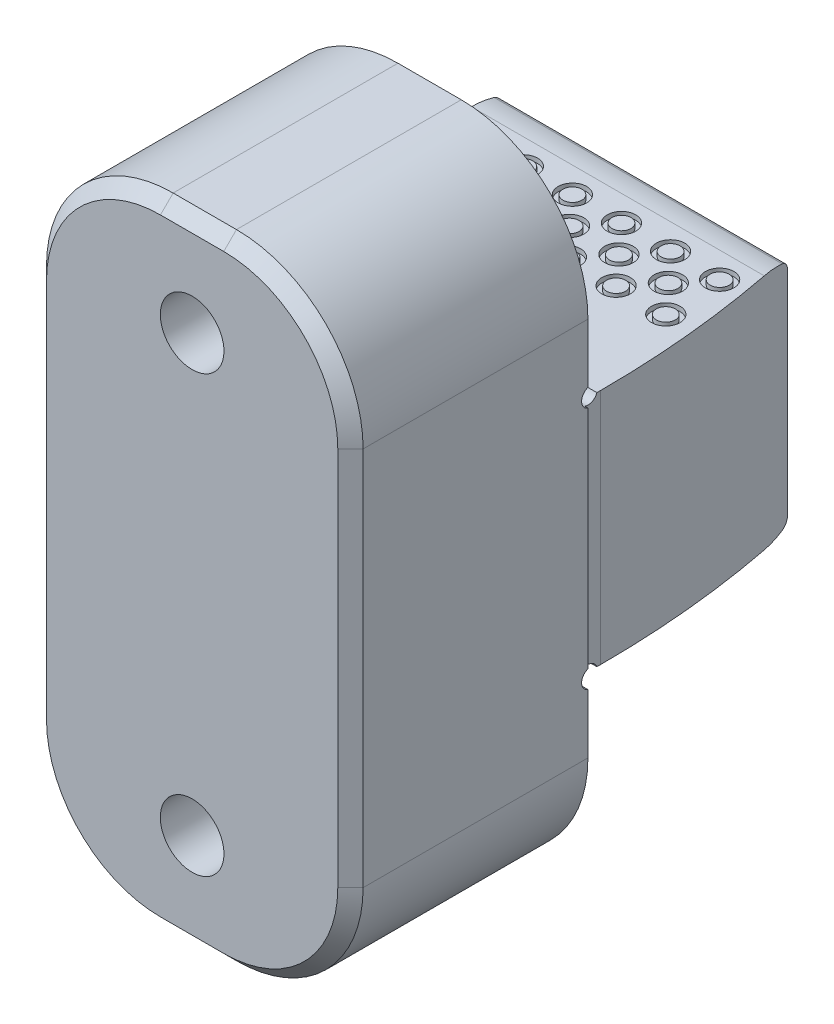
from build123d import *

# Parameters (mm, degrees)
EXTRUDE1_DEPTH          = 12.7
SKETCH7_W               = 21.968267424
SKETCH7_H               = 31.720833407
CUT_EXTRUDE3_DEPTH      = 0.254
SKETCH8_R               = 0.762
CUT_EXTRUDE4_DEPTH      = 41.659838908
CUT_EXTRUDE5_DEPTH      = 41.659838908
CUT_EXTRUDE6_DEPTH      = 56.72102386
SKETCH15_R              = 1.143
SKETCH15_R_2            = 0.762
CUT_EXTRUDE7_DEPTH      = 0.381
F_10_CBORE_D            = 4.572
F_10_CBORE_CBORE_D      = 9.525
F_10_CBORE_CBORE_DEPTH  = 5.62102
F_1_4_20_TAPPED_HOLE1_D = 5.1054
FILLET1_R               = 10.16
CHAMFER1_SIZE           = 1.016


with BuildPart() as part:
    # Sketch3 → Extrude1 (new, symmetric)
    with BuildSketch(Plane(origin=(0, 0, 0), x_dir=(0, 0, -1), z_dir=(1, 0, 0))):
        Polygon((-19.05, -25.4), (0, -25.4), (0, -9.52246), (18.161, -9.52246), (18.161, 9.52246), (0, 9.52246), (0, 25.4), (-19.05, 25.4), align=None)
    extrude(amount=EXTRUDE1_DEPTH, both=True)

    # Sketch7 → Cut-Extrude3 (cut)
    with BuildSketch(Plane(origin=(12.7, 0, 0), x_dir=(0, 0, -1), z_dir=(1, 0, 0))):
        with Locations((10.984133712, 1.307835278)):
            Rectangle(SKETCH7_W, SKETCH7_H)
    cut_extrude3 = extrude(amount=-CUT_EXTRUDE3_DEPTH, mode=Mode.SUBTRACT)

    # Mirror2: Cut-Extrude3 across plane
    add(cut_extrude3.mirror(Plane(origin=(0, 0, 0), x_dir=(0, 0, 1), z_dir=(1, 0, 0))), mode=Mode.SUBTRACT)

    # Sketch8 → Cut-Extrude4 (cut, through all)
    with BuildSketch(Plane(origin=(12.7, 0, 0), x_dir=(0, 0, -1), z_dir=(1, 0, 0))):
        with Locations((0.254, 9.77646)):
            Circle(SKETCH8_R)
        with Locations((0.254, -9.77646)):
            Circle(SKETCH8_R)
    extrude(amount=-CUT_EXTRUDE4_DEPTH, mode=Mode.SUBTRACT)

    # Sketch9 → Cut-Extrude5 (cut, through all)
    with BuildSketch(Plane(origin=(12.7, 0, 0), x_dir=(0, 0, -1), z_dir=(1, 0, 0))):
        with BuildLine():
            Line((18.161, 8.526440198), (22.1488, 8.526440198))
            Line((22.1488, 8.526440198), (22.1488, 14.876440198))
            Line((22.1488, 14.876440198), (15.7988, 14.876440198))
            Line((15.7988, 14.876440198), (15.7988, 9.52246))
            ThreePointArc((15.7988, 9.52246), (16.71767584, 9.45562538), (17.617209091, 9.256528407))
            ThreePointArc((17.617209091, 9.256528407), (18.010113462, 8.981615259), (18.161, 8.526440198))
        make_face()
        with BuildLine():
            Line((22.1488, -8.526440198), (22.1488, -14.876440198))
            Line((22.1488, -14.876440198), (15.7988, -14.876440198))
            Line((15.7988, -14.876440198), (15.7988, -9.52246))
            ThreePointArc((15.7988, -9.52246), (16.71767584, -9.45562538), (17.617209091, -9.256528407))
            ThreePointArc((17.617209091, -9.256528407), (18.010113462, -8.981615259), (18.161, -8.526440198))
            Line((18.161, -8.526440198), (22.1488, -8.526440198))
        make_face()
    extrude(amount=-CUT_EXTRUDE5_DEPTH, mode=Mode.SUBTRACT)

    # Sketch13 → Cut-Extrude6 (cut, through all)
    with BuildSketch(Plane(origin=(0, 25.4, 0), x_dir=(1, 0, 0), z_dir=(0, 1, 0))):
        with BuildLine():
            Line((8.088048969, 26.67), (20.788048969, 26.67))
            Line((20.788048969, 26.67), (20.788048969, 1.27))
            Line((20.788048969, 1.27), (12.446, 1.27))
            ThreePointArc((12.446, 1.27), (11.348610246, 14.155570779), (8.088048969, 26.67))
        make_face()
    extrude(amount=-CUT_EXTRUDE6_DEPTH, mode=Mode.SUBTRACT)

    # Sketch15 → Cut-Extrude7 (cut)
    # profile 1 of 17: a face of its own
    with BuildSketch(Plane(origin=(0, 9.52246, 0), x_dir=(1, 0, 0), z_dir=(0, 1, 0))):
        with Locations(Location((-6.223, 13.7414, 0), (0, 0, 270))):
            Circle(SKETCH15_R)
        with Locations(Location((-6.223, 13.7414, 0), (0, 0, 270))):
            Circle(SKETCH15_R_2, mode=Mode.SUBTRACT)
    # profile 2 of 17: a face of its own
    with BuildSketch(Plane(origin=(0, 9.52246, 0), x_dir=(1, 0, 0), z_dir=(0, 1, 0))):
        with Locations(Location((-2.286, 13.7414, 0), (0, 0, 270))):
            Circle(SKETCH15_R)
        with Locations(Location((-2.286, 13.7414, 0), (0, 0, 270))):
            Circle(SKETCH15_R_2, mode=Mode.SUBTRACT)
    # profile 3 of 17: a face of its own
    with BuildSketch(Plane(origin=(0, 9.52246, 0), x_dir=(1, 0, 0), z_dir=(0, 1, 0))):
        with Locations(Location((-10.16, 13.7414, 0), (0, 0, 270))):
            Circle(SKETCH15_R)
        with Locations(Location((-10.16, 13.7414, 0), (0, 0, 270))):
            Circle(SKETCH15_R_2, mode=Mode.SUBTRACT)
    # profile 4 of 17: a face of its own
    with BuildSketch(Plane(origin=(0, 9.52246, 0), x_dir=(1, 0, 0), z_dir=(0, 1, 0))):
        with Locations(Location((1.651, 13.7414, 0), (0, 0, 270))):
            Circle(SKETCH15_R)
        with Locations(Location((1.651, 13.7414, 0), (0, 0, 270))):
            Circle(SKETCH15_R_2, mode=Mode.SUBTRACT)
    # profile 5 of 17: a face of its own
    with BuildSketch(Plane(origin=(0, 9.52246, 0), x_dir=(1, 0, 0), z_dir=(0, 1, 0))):
        with Locations(Location((5.588, 13.7414, 0), (0, 0, 270))):
            Circle(SKETCH15_R)
        with Locations(Location((5.588, 13.7414, 0), (0, 0, 270))):
            Circle(SKETCH15_R_2, mode=Mode.SUBTRACT)
    # profile 6 of 17: a face of its own
    with BuildSketch(Plane(origin=(0, 9.52246, 0), x_dir=(1, 0, 0), z_dir=(0, 1, 0))):
        with Locations(Location((9.525, 13.7414, 0), (0, 0, 270))):
            Circle(SKETCH15_R)
        with Locations(Location((9.525, 13.7414, 0), (0, 0, 270))):
            Circle(SKETCH15_R_2, mode=Mode.SUBTRACT)
    # profile 7 of 17: a face of its own
    with BuildSketch(Plane(origin=(0, 9.52246, 0), x_dir=(1, 0, 0), z_dir=(0, 1, 0))):
        with Locations(Location((-4.191, 11.4554, 0), (0, 0, 270))):
            Circle(SKETCH15_R)
        with Locations(Location((-4.191, 11.4554, 0), (0, 0, 270))):
            Circle(SKETCH15_R_2, mode=Mode.SUBTRACT)
    # profile 8 of 17: a face of its own
    with BuildSketch(Plane(origin=(0, 9.52246, 0), x_dir=(1, 0, 0), z_dir=(0, 1, 0))):
        with Locations(Location((-0.2286, 11.4554, 0), (0, 0, 270))):
            Circle(SKETCH15_R)
        with Locations(Location((-0.2286, 11.4554, 0), (0, 0, 270))):
            Circle(SKETCH15_R_2, mode=Mode.SUBTRACT)
    # profile 9 of 17: a face of its own
    with BuildSketch(Plane(origin=(0, 9.52246, 0), x_dir=(1, 0, 0), z_dir=(0, 1, 0))):
        with Locations(Location((-8.1534, 11.4554, 0), (0, 0, 270))):
            Circle(SKETCH15_R)
        with Locations(Location((-8.1534, 11.4554, 0), (0, 0, 270))):
            Circle(SKETCH15_R_2, mode=Mode.SUBTRACT)
    # profile 10 of 17: a face of its own
    with BuildSketch(Plane(origin=(0, 9.52246, 0), x_dir=(1, 0, 0), z_dir=(0, 1, 0))):
        with Locations(Location((3.7338, 11.4554, 0), (0, 0, 270))):
            Circle(SKETCH15_R)
        with Locations(Location((3.7338, 11.4554, 0), (0, 0, 270))):
            Circle(SKETCH15_R_2, mode=Mode.SUBTRACT)
    # profile 11 of 17: a face of its own
    with BuildSketch(Plane(origin=(0, 9.52246, 0), x_dir=(1, 0, 0), z_dir=(0, 1, 0))):
        with Locations(Location((7.6962, 11.4554, 0), (0, 0, 270))):
            Circle(SKETCH15_R)
        with Locations(Location((7.6962, 11.4554, 0), (0, 0, 270))):
            Circle(SKETCH15_R_2, mode=Mode.SUBTRACT)
    # profile 12 of 17: a face of its own
    with BuildSketch(Plane(origin=(0, 9.52246, 0), x_dir=(1, 0, 0), z_dir=(0, 1, 0))):
        with Locations(Location((-6.1722, 9.1694, 0), (0, 0, 270))):
            Circle(SKETCH15_R)
        with Locations(Location((-6.1722, 9.1694, 0), (0, 0, 270))):
            Circle(SKETCH15_R_2, mode=Mode.SUBTRACT)
    # profile 13 of 17: a face of its own
    with BuildSketch(Plane(origin=(0, 9.52246, 0), x_dir=(1, 0, 0), z_dir=(0, 1, 0))):
        with Locations(Location((-2.1844, 9.1694, 0), (0, 0, 270))):
            Circle(SKETCH15_R)
        with Locations(Location((-2.1844, 9.1694, 0), (0, 0, 270))):
            Circle(SKETCH15_R_2, mode=Mode.SUBTRACT)
    # profile 14 of 17: a face of its own
    with BuildSketch(Plane(origin=(0, 9.52246, 0), x_dir=(1, 0, 0), z_dir=(0, 1, 0))):
        with Locations(Location((-10.16, 9.1694, 0), (0, 0, 270))):
            Circle(SKETCH15_R)
        with Locations(Location((-10.16, 9.1694, 0), (0, 0, 270))):
            Circle(SKETCH15_R_2, mode=Mode.SUBTRACT)
    # profile 15 of 17: a face of its own
    with BuildSketch(Plane(origin=(0, 9.52246, 0), x_dir=(1, 0, 0), z_dir=(0, 1, 0))):
        with Locations(Location((1.8034, 9.1694, 0), (0, 0, 270))):
            Circle(SKETCH15_R)
        with Locations(Location((1.8034, 9.1694, 0), (0, 0, 270))):
            Circle(SKETCH15_R_2, mode=Mode.SUBTRACT)
    # profile 16 of 17: a face of its own
    with BuildSketch(Plane(origin=(0, 9.52246, 0), x_dir=(1, 0, 0), z_dir=(0, 1, 0))):
        with Locations(Location((5.7912, 9.1694, 0), (0, 0, 270))):
            Circle(SKETCH15_R)
        with Locations(Location((5.7912, 9.1694, 0), (0, 0, 270))):
            Circle(SKETCH15_R_2, mode=Mode.SUBTRACT)
    # profile 17 of 17: a face of its own
    with BuildSketch(Plane(origin=(0, 9.52246, 0), x_dir=(1, 0, 0), z_dir=(0, 1, 0))):
        with Locations(Location((9.779, 9.1694, 0), (0, 0, 270))):
            Circle(SKETCH15_R)
        with Locations(Location((9.779, 9.1694, 0), (0, 0, 270))):
            Circle(SKETCH15_R_2, mode=Mode.SUBTRACT)
    cut_extrude7 = extrude(amount=-CUT_EXTRUDE7_DEPTH, mode=Mode.SUBTRACT)

    # Mirror1: Cut-Extrude7 across plane
    add(cut_extrude7.mirror(Plane.ZX), mode=Mode.SUBTRACT)

    # 10 CBORE (through all)
    with Locations(Plane(origin=(0, 0, 0), x_dir=(-1, 0, 0), z_dir=(0, 0, -1))):
        with Locations((0, 17.4625), (0, -17.4625)):
            CounterBoreHole(F_10_CBORE_D / 2, F_10_CBORE_CBORE_D / 2, F_10_CBORE_CBORE_DEPTH)

    # 1_4-20 Tapped Hole1 (through all)
    with Locations(Plane(origin=(0, 0, 5.62102), x_dir=(-1, 0, 0), z_dir=(0, 0, -1))):
        with Locations((0, 17.4625), (0, -17.4625)):
            Hole(F_1_4_20_TAPPED_HOLE1_D / 2)

    # Fillet1
    fillet1_edges = [part.edges().sort_by_distance(p)[0] for p in [
        (-12.7, -25.4, 9.525),
        (12.7, 25.4, 9.525),
        (12.7, -25.4, 9.525),
        (-12.7, 25.4, 9.525),
    ]]
    fillet(fillet1_edges, radius=FILLET1_R)

    # Chamfer1
    chamfer1_edges = [part.edges().sort_by_distance(p)[0] for p in [
        (12.7, 0, 19.05),
        (0, -25.4, 19.05),
        (-12.7, 0, 19.05),
        (0, 25.4, 19.05),
        (-9.724204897, -22.424204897, 19.05),
        (-9.724204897, 22.424204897, 19.05),
        (9.724204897, 22.424204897, 19.05),
        (9.724204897, -22.424204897, 19.05),
    ]]
    chamfer(chamfer1_edges, length=CHAMFER1_SIZE)


solid = part.part
